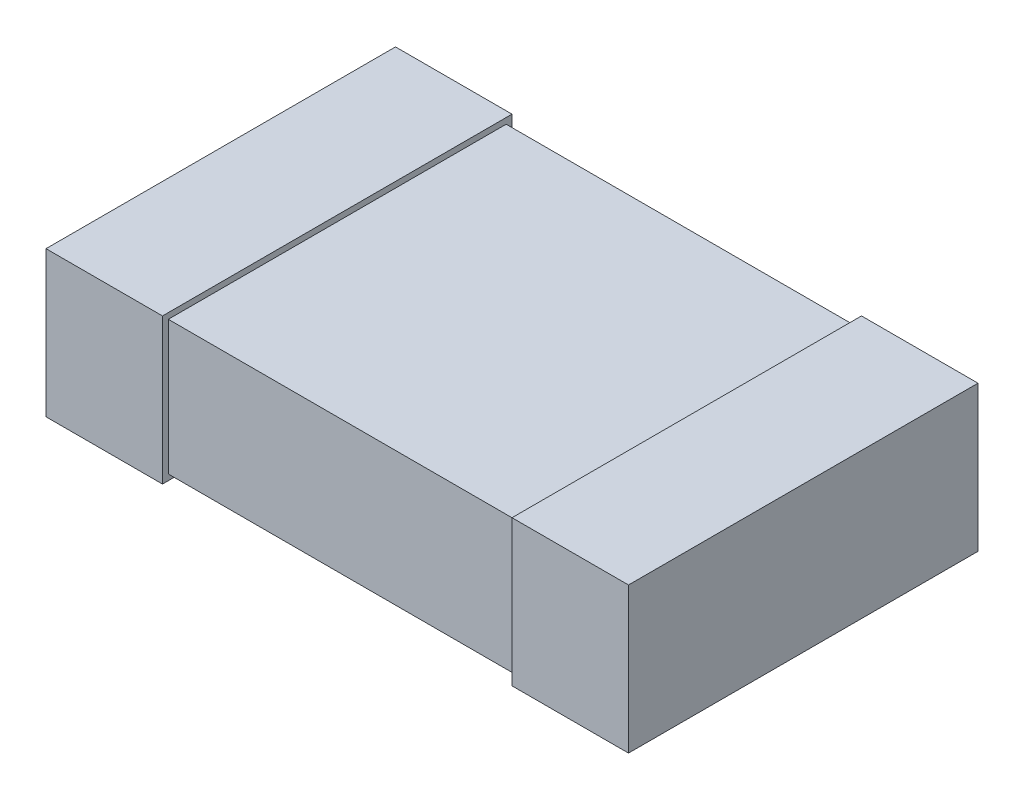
ISO-10303-21;
HEADER;
FILE_DESCRIPTION(('STEP AP214'),'2;1');
FILE_NAME('part.step','',(''),(''),'','','');
FILE_SCHEMA(('AUTOMOTIVE_DESIGN { 1 0 10303 214 1 1 1 1 }'));
ENDSEC;
DATA;
#1=APPLICATION_CONTEXT('core data for automotive mechanical design processes');
#2=APPLICATION_PROTOCOL_DEFINITION('international standard','automotive_design',2000,#1);
#3=PRODUCT_CONTEXT('',#1,'mechanical');
#4=PRODUCT('Part','Part','',(#3));
#5=PRODUCT_RELATED_PRODUCT_CATEGORY('part','',(#4));
#6=PRODUCT_DEFINITION_FORMATION('','',#4);
#7=PRODUCT_DEFINITION_CONTEXT('part definition',#1,'design');
#8=PRODUCT_DEFINITION('design','',#6,#7);
#9=PRODUCT_DEFINITION_SHAPE('','',#8);
#10=(LENGTH_UNIT() NAMED_UNIT(*) SI_UNIT(.MILLI.,.METRE.));
#11=(NAMED_UNIT(*) PLANE_ANGLE_UNIT() SI_UNIT($,.RADIAN.));
#12=(NAMED_UNIT(*) SI_UNIT($,.STERADIAN.) SOLID_ANGLE_UNIT());
#13=UNCERTAINTY_MEASURE_WITH_UNIT(LENGTH_MEASURE(1.E-05),#10,'distance_accuracy_value','');
#14=(GEOMETRIC_REPRESENTATION_CONTEXT(3) GLOBAL_UNCERTAINTY_ASSIGNED_CONTEXT((#13)) GLOBAL_UNIT_ASSIGNED_CONTEXT((#10,
#11,#12)) REPRESENTATION_CONTEXT('',''));
#15=CARTESIAN_POINT('',(0.,0.,0.));
#16=DIRECTION('',(0.,0.,1.));
#17=DIRECTION('',(1.,0.,0.));
#18=AXIS2_PLACEMENT_3D('',#15,#16,#17);
#19=CARTESIAN_POINT('',(-0.6,0.5,0.6));
#20=DIRECTION('',(-1.,0.,0.));
#21=DIRECTION('',(0.,0.,1.));
#22=AXIS2_PLACEMENT_3D('',#19,#20,#21);
#23=PLANE('',#22);
#24=DIRECTION('',(0.,0.,-1.));
#25=VECTOR('',#24,1.);
#26=CARTESIAN_POINT('',(-0.6,0.,0.6));
#27=LINE('',#26,#25);
#28=CARTESIAN_POINT('',(-0.6,0.,0.6));
#29=VERTEX_POINT('',#28);
#30=CARTESIAN_POINT('',(-0.6,0.,-0.6));
#31=VERTEX_POINT('',#30);
#32=EDGE_CURVE('E223',#29,#31,#27,.T.);
#33=ORIENTED_EDGE('',*,*,#32,.T.);
#34=DIRECTION('',(0.,-1.,0.));
#35=VECTOR('',#34,1.);
#36=CARTESIAN_POINT('',(-0.6,0.5,-0.6));
#37=LINE('',#36,#35);
#38=CARTESIAN_POINT('',(-0.6,0.5,-0.6));
#39=VERTEX_POINT('',#38);
#40=EDGE_CURVE('E231',#39,#31,#37,.T.);
#41=ORIENTED_EDGE('',*,*,#40,.F.);
#42=DIRECTION('',(0.,0.,-1.));
#43=VECTOR('',#42,1.);
#44=CARTESIAN_POINT('',(-0.6,0.5,0.6));
#45=LINE('',#44,#43);
#46=CARTESIAN_POINT('',(-0.6,0.5,0.6));
#47=VERTEX_POINT('',#46);
#48=EDGE_CURVE('E211',#47,#39,#45,.T.);
#49=ORIENTED_EDGE('',*,*,#48,.F.);
#50=DIRECTION('',(0.,-1.,0.));
#51=VECTOR('',#50,1.);
#52=CARTESIAN_POINT('',(-0.6,0.5,0.6));
#53=LINE('',#52,#51);
#54=EDGE_CURVE('E45',#47,#29,#53,.T.);
#55=ORIENTED_EDGE('',*,*,#54,.T.);
#56=EDGE_LOOP('',(#33,#41,#49,#55));
#57=FACE_BOUND('',#56,.T.);
#58=DIRECTION('',(0.,-1.,0.));
#59=VECTOR('',#58,1.);
#60=CARTESIAN_POINT('',(-0.6,0.48,0.58));
#61=LINE('',#60,#59);
#62=CARTESIAN_POINT('',(-0.6,0.48,0.58));
#63=VERTEX_POINT('',#62);
#64=CARTESIAN_POINT('',(-0.6,0.0200000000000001,0.58));
#65=VERTEX_POINT('',#64);
#66=EDGE_CURVE('E159',#63,#65,#61,.T.);
#67=ORIENTED_EDGE('',*,*,#66,.F.);
#68=DIRECTION('',(0.,0.,1.));
#69=VECTOR('',#68,1.);
#70=CARTESIAN_POINT('',(-0.6,0.48,-0.58));
#71=LINE('',#70,#69);
#72=CARTESIAN_POINT('',(-0.6,0.48,-0.58));
#73=VERTEX_POINT('',#72);
#74=EDGE_CURVE('E166',#73,#63,#71,.T.);
#75=ORIENTED_EDGE('',*,*,#74,.F.);
#76=DIRECTION('',(0.,1.,0.));
#77=VECTOR('',#76,1.);
#78=CARTESIAN_POINT('',(-0.6,0.0200000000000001,-0.58));
#79=LINE('',#78,#77);
#80=CARTESIAN_POINT('',(-0.6,0.0200000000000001,-0.58));
#81=VERTEX_POINT('',#80);
#82=EDGE_CURVE('E57',#81,#73,#79,.T.);
#83=ORIENTED_EDGE('',*,*,#82,.F.);
#84=DIRECTION('',(0.,0.,-1.));
#85=VECTOR('',#84,1.);
#86=CARTESIAN_POINT('',(-0.6,0.02,0.58));
#87=LINE('',#86,#85);
#88=EDGE_CURVE('E52',#65,#81,#87,.T.);
#89=ORIENTED_EDGE('',*,*,#88,.F.);
#90=EDGE_LOOP('',(#67,#75,#83,#89));
#91=FACE_BOUND('',#90,.T.);
#92=ADVANCED_FACE('F36',(#57,#91),#23,.F.);
#93=CARTESIAN_POINT('',(-1.,0.5,0.6));
#94=DIRECTION('',(1.,0.,0.));
#95=DIRECTION('',(0.,0.,-1.));
#96=AXIS2_PLACEMENT_3D('',#93,#94,#95);
#97=PLANE('',#96);
#98=DIRECTION('',(0.,0.,1.));
#99=VECTOR('',#98,1.);
#100=CARTESIAN_POINT('',(-1.,0.,0.6));
#101=LINE('',#100,#99);
#102=CARTESIAN_POINT('',(-1.,0.,-0.6));
#103=VERTEX_POINT('',#102);
#104=CARTESIAN_POINT('',(-1.,0.,0.6));
#105=VERTEX_POINT('',#104);
#106=EDGE_CURVE('E185',#103,#105,#101,.T.);
#107=ORIENTED_EDGE('',*,*,#106,.T.);
#108=DIRECTION('',(0.,-1.,0.));
#109=VECTOR('',#108,1.);
#110=CARTESIAN_POINT('',(-1.,0.5,0.6));
#111=LINE('',#110,#109);
#112=CARTESIAN_POINT('',(-1.,0.5,0.6));
#113=VERTEX_POINT('',#112);
#114=EDGE_CURVE('E11',#113,#105,#111,.T.);
#115=ORIENTED_EDGE('',*,*,#114,.F.);
#116=DIRECTION('',(0.,0.,1.));
#117=VECTOR('',#116,1.);
#118=CARTESIAN_POINT('',(-1.,0.5,0.6));
#119=LINE('',#118,#117);
#120=CARTESIAN_POINT('',(-1.,0.5,-0.6));
#121=VERTEX_POINT('',#120);
#122=EDGE_CURVE('E204',#121,#113,#119,.T.);
#123=ORIENTED_EDGE('',*,*,#122,.F.);
#124=DIRECTION('',(0.,-1.,0.));
#125=VECTOR('',#124,1.);
#126=CARTESIAN_POINT('',(-1.,0.5,-0.6));
#127=LINE('',#126,#125);
#128=EDGE_CURVE('E217',#121,#103,#127,.T.);
#129=ORIENTED_EDGE('',*,*,#128,.T.);
#130=EDGE_LOOP('',(#107,#115,#123,#129));
#131=FACE_BOUND('',#130,.T.);
#132=ADVANCED_FACE('F38',(#131),#97,.F.);
#133=CARTESIAN_POINT('',(-1.,0.5,0.6));
#134=DIRECTION('',(0.,0.,-1.));
#135=DIRECTION('',(-1.,0.,0.));
#136=AXIS2_PLACEMENT_3D('',#133,#134,#135);
#137=PLANE('',#136);
#138=DIRECTION('',(1.,0.,0.));
#139=VECTOR('',#138,1.);
#140=CARTESIAN_POINT('',(-1.,0.,0.6));
#141=LINE('',#140,#139);
#142=EDGE_CURVE('E220',#105,#29,#141,.T.);
#143=ORIENTED_EDGE('',*,*,#142,.T.);
#144=ORIENTED_EDGE('',*,*,#54,.F.);
#145=DIRECTION('',(1.,0.,0.));
#146=VECTOR('',#145,1.);
#147=CARTESIAN_POINT('',(-1.,0.5,0.6));
#148=LINE('',#147,#146);
#149=EDGE_CURVE('E208',#113,#47,#148,.T.);
#150=ORIENTED_EDGE('',*,*,#149,.F.);
#151=ORIENTED_EDGE('',*,*,#114,.T.);
#152=EDGE_LOOP('',(#143,#144,#150,#151));
#153=FACE_BOUND('',#152,.T.);
#154=ADVANCED_FACE('F257',(#153),#137,.F.);
#155=CARTESIAN_POINT('',(-1.,0.5,-0.6));
#156=DIRECTION('',(0.,0.,1.));
#157=DIRECTION('',(1.,0.,0.));
#158=AXIS2_PLACEMENT_3D('',#155,#156,#157);
#159=PLANE('',#158);
#160=DIRECTION('',(-1.,0.,0.));
#161=VECTOR('',#160,1.);
#162=CARTESIAN_POINT('',(-1.,0.,-0.6));
#163=LINE('',#162,#161);
#164=EDGE_CURVE('E209',#31,#103,#163,.T.);
#165=ORIENTED_EDGE('',*,*,#164,.T.);
#166=ORIENTED_EDGE('',*,*,#128,.F.);
#167=DIRECTION('',(-1.,0.,0.));
#168=VECTOR('',#167,1.);
#169=CARTESIAN_POINT('',(-1.,0.5,-0.6));
#170=LINE('',#169,#168);
#171=EDGE_CURVE('E214',#39,#121,#170,.T.);
#172=ORIENTED_EDGE('',*,*,#171,.F.);
#173=ORIENTED_EDGE('',*,*,#40,.T.);
#174=EDGE_LOOP('',(#165,#166,#172,#173));
#175=FACE_BOUND('',#174,.T.);
#176=ADVANCED_FACE('F250',(#175),#159,.F.);
#177=CARTESIAN_POINT('',(-1.,0.5,-0.6));
#178=DIRECTION('',(0.,-1.,0.));
#179=DIRECTION('',(0.,0.,-1.));
#180=AXIS2_PLACEMENT_3D('',#177,#178,#179);
#181=PLANE('',#180);
#182=ORIENTED_EDGE('',*,*,#122,.T.);
#183=ORIENTED_EDGE('',*,*,#149,.T.);
#184=ORIENTED_EDGE('',*,*,#48,.T.);
#185=ORIENTED_EDGE('',*,*,#171,.T.);
#186=EDGE_LOOP('',(#182,#183,#184,#185));
#187=FACE_BOUND('',#186,.T.);
#188=ADVANCED_FACE('F256',(#187),#181,.F.);
#189=CARTESIAN_POINT('',(-1.,0.,-0.6));
#190=DIRECTION('',(0.,-1.,0.));
#191=DIRECTION('',(0.,0.,-1.));
#192=AXIS2_PLACEMENT_3D('',#189,#190,#191);
#193=PLANE('',#192);
#194=ORIENTED_EDGE('',*,*,#106,.F.);
#195=ORIENTED_EDGE('',*,*,#164,.F.);
#196=ORIENTED_EDGE('',*,*,#32,.F.);
#197=ORIENTED_EDGE('',*,*,#142,.F.);
#198=EDGE_LOOP('',(#194,#195,#196,#197));
#199=FACE_BOUND('',#198,.T.);
#200=ADVANCED_FACE('F247',(#199),#193,.T.);
#201=CARTESIAN_POINT('',(1.84787819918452,0.48,0.58));
#202=DIRECTION('',(0.,0.,-1.));
#203=DIRECTION('',(0.,1.,0.));
#204=AXIS2_PLACEMENT_3D('',#201,#202,#203);
#205=PLANE('',#204);
#206=DIRECTION('',(0.,-1.,0.));
#207=VECTOR('',#206,1.);
#208=CARTESIAN_POINT('',(0.6,0.48,0.58));
#209=LINE('',#208,#207);
#210=CARTESIAN_POINT('',(0.6,0.48,0.58));
#211=VERTEX_POINT('',#210);
#212=CARTESIAN_POINT('',(0.600000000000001,0.02,0.58));
#213=VERTEX_POINT('',#212);
#214=EDGE_CURVE('E190',#211,#213,#209,.T.);
#215=ORIENTED_EDGE('',*,*,#214,.F.);
#216=DIRECTION('',(-1.,0.,0.));
#217=VECTOR('',#216,1.);
#218=CARTESIAN_POINT('',(1.84787819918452,0.48,0.58));
#219=LINE('',#218,#217);
#220=EDGE_CURVE('E153',#211,#63,#219,.T.);
#221=ORIENTED_EDGE('',*,*,#220,.T.);
#222=ORIENTED_EDGE('',*,*,#66,.T.);
#223=DIRECTION('',(-1.,0.,0.));
#224=VECTOR('',#223,1.);
#225=CARTESIAN_POINT('',(1.84787819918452,0.02,0.58));
#226=LINE('',#225,#224);
#227=EDGE_CURVE('E177',#213,#65,#226,.T.);
#228=ORIENTED_EDGE('',*,*,#227,.F.);
#229=EDGE_LOOP('',(#215,#221,#222,#228));
#230=FACE_BOUND('',#229,.T.);
#231=ADVANCED_FACE('F269',(#230),#205,.F.);
#232=CARTESIAN_POINT('',(1.84787819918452,0.02,0.58));
#233=DIRECTION('',(0.,1.,0.));
#234=DIRECTION('',(0.,0.,1.));
#235=AXIS2_PLACEMENT_3D('',#232,#233,#234);
#236=PLANE('',#235);
#237=DIRECTION('',(0.,0.,-1.));
#238=VECTOR('',#237,1.);
#239=CARTESIAN_POINT('',(0.6,0.02,0.58));
#240=LINE('',#239,#238);
#241=CARTESIAN_POINT('',(0.600000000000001,0.0200000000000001,-0.58));
#242=VERTEX_POINT('',#241);
#243=EDGE_CURVE('E186',#213,#242,#240,.T.);
#244=ORIENTED_EDGE('',*,*,#243,.F.);
#245=ORIENTED_EDGE('',*,*,#227,.T.);
#246=ORIENTED_EDGE('',*,*,#88,.T.);
#247=DIRECTION('',(-1.,0.,0.));
#248=VECTOR('',#247,1.);
#249=CARTESIAN_POINT('',(1.84787819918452,0.0200000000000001,-0.58));
#250=LINE('',#249,#248);
#251=EDGE_CURVE('E174',#242,#81,#250,.T.);
#252=ORIENTED_EDGE('',*,*,#251,.F.);
#253=EDGE_LOOP('',(#244,#245,#246,#252));
#254=FACE_BOUND('',#253,.T.);
#255=ADVANCED_FACE('F274',(#254),#236,.F.);
#256=CARTESIAN_POINT('',(1.84787819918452,0.0200000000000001,-0.58));
#257=DIRECTION('',(0.,0.,1.));
#258=DIRECTION('',(1.,0.,0.));
#259=AXIS2_PLACEMENT_3D('',#256,#257,#258);
#260=PLANE('',#259);
#261=DIRECTION('',(0.,1.,0.));
#262=VECTOR('',#261,1.);
#263=CARTESIAN_POINT('',(0.6,0.0200000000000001,-0.58));
#264=LINE('',#263,#262);
#265=CARTESIAN_POINT('',(0.600000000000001,0.48,-0.58));
#266=VERTEX_POINT('',#265);
#267=EDGE_CURVE('E181',#242,#266,#264,.T.);
#268=ORIENTED_EDGE('',*,*,#267,.F.);
#269=ORIENTED_EDGE('',*,*,#251,.T.);
#270=ORIENTED_EDGE('',*,*,#82,.T.);
#271=DIRECTION('',(-1.,0.,0.));
#272=VECTOR('',#271,1.);
#273=CARTESIAN_POINT('',(1.84787819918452,0.48,-0.58));
#274=LINE('',#273,#272);
#275=EDGE_CURVE('E171',#266,#73,#274,.T.);
#276=ORIENTED_EDGE('',*,*,#275,.F.);
#277=EDGE_LOOP('',(#268,#269,#270,#276));
#278=FACE_BOUND('',#277,.T.);
#279=ADVANCED_FACE('F278',(#278),#260,.F.);
#280=CARTESIAN_POINT('',(1.84787819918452,0.48,-0.58));
#281=DIRECTION('',(0.,-1.,0.));
#282=DIRECTION('',(0.,0.,-1.));
#283=AXIS2_PLACEMENT_3D('',#280,#281,#282);
#284=PLANE('',#283);
#285=DIRECTION('',(0.,0.,1.));
#286=VECTOR('',#285,1.);
#287=CARTESIAN_POINT('',(0.6,0.48,-0.58));
#288=LINE('',#287,#286);
#289=EDGE_CURVE('E170',#266,#211,#288,.T.);
#290=ORIENTED_EDGE('',*,*,#289,.F.);
#291=ORIENTED_EDGE('',*,*,#275,.T.);
#292=ORIENTED_EDGE('',*,*,#74,.T.);
#293=ORIENTED_EDGE('',*,*,#220,.F.);
#294=EDGE_LOOP('',(#290,#291,#292,#293));
#295=FACE_BOUND('',#294,.T.);
#296=ADVANCED_FACE('F282',(#295),#284,.F.);
#297=CARTESIAN_POINT('',(0.6,0.5,0.6));
#298=DIRECTION('',(1.,0.,0.));
#299=DIRECTION('',(0.,0.,-1.));
#300=AXIS2_PLACEMENT_3D('',#297,#298,#299);
#301=PLANE('',#300);
#302=DIRECTION('',(0.,0.,1.));
#303=VECTOR('',#302,1.);
#304=CARTESIAN_POINT('',(0.6,0.,0.6));
#305=LINE('',#304,#303);
#306=CARTESIAN_POINT('',(0.6,0.,-0.6));
#307=VERTEX_POINT('',#306);
#308=CARTESIAN_POINT('',(0.6,0.,0.6));
#309=VERTEX_POINT('',#308);
#310=EDGE_CURVE('E147',#307,#309,#305,.T.);
#311=ORIENTED_EDGE('',*,*,#310,.T.);
#312=DIRECTION('',(0.,-1.,0.));
#313=VECTOR('',#312,1.);
#314=CARTESIAN_POINT('',(0.6,0.5,0.6));
#315=LINE('',#314,#313);
#316=CARTESIAN_POINT('',(0.6,0.5,0.6));
#317=VERTEX_POINT('',#316);
#318=EDGE_CURVE('E429',#317,#309,#315,.T.);
#319=ORIENTED_EDGE('',*,*,#318,.F.);
#320=DIRECTION('',(0.,0.,1.));
#321=VECTOR('',#320,1.);
#322=CARTESIAN_POINT('',(0.6,0.5,0.6));
#323=LINE('',#322,#321);
#324=CARTESIAN_POINT('',(0.6,0.5,-0.6));
#325=VERTEX_POINT('',#324);
#326=EDGE_CURVE('E142',#325,#317,#323,.T.);
#327=ORIENTED_EDGE('',*,*,#326,.F.);
#328=DIRECTION('',(0.,-1.,0.));
#329=VECTOR('',#328,1.);
#330=CARTESIAN_POINT('',(0.6,0.5,-0.6));
#331=LINE('',#330,#329);
#332=EDGE_CURVE('E162',#325,#307,#331,.T.);
#333=ORIENTED_EDGE('',*,*,#332,.T.);
#334=EDGE_LOOP('',(#311,#319,#327,#333));
#335=FACE_BOUND('',#334,.T.);
#336=ORIENTED_EDGE('',*,*,#289,.T.);
#337=ORIENTED_EDGE('',*,*,#214,.T.);
#338=ORIENTED_EDGE('',*,*,#243,.T.);
#339=ORIENTED_EDGE('',*,*,#267,.T.);
#340=EDGE_LOOP('',(#336,#337,#338,#339));
#341=FACE_BOUND('',#340,.T.);
#342=ADVANCED_FACE('F286',(#335,#341),#301,.F.);
#343=CARTESIAN_POINT('',(1.,0.5,0.6));
#344=DIRECTION('',(0.,0.,-1.));
#345=DIRECTION('',(-1.,0.,0.));
#346=AXIS2_PLACEMENT_3D('',#343,#344,#345);
#347=PLANE('',#346);
#348=DIRECTION('',(1.,0.,0.));
#349=VECTOR('',#348,1.);
#350=CARTESIAN_POINT('',(1.,0.,0.6));
#351=LINE('',#350,#349);
#352=CARTESIAN_POINT('',(1.,0.,0.6));
#353=VERTEX_POINT('',#352);
#354=EDGE_CURVE('E151',#309,#353,#351,.T.);
#355=ORIENTED_EDGE('',*,*,#354,.T.);
#356=DIRECTION('',(0.,-1.,0.));
#357=VECTOR('',#356,1.);
#358=CARTESIAN_POINT('',(1.,0.5,0.6));
#359=LINE('',#358,#357);
#360=CARTESIAN_POINT('',(1.,0.5,0.6));
#361=VERTEX_POINT('',#360);
#362=EDGE_CURVE('E129',#361,#353,#359,.T.);
#363=ORIENTED_EDGE('',*,*,#362,.F.);
#364=DIRECTION('',(1.,0.,0.));
#365=VECTOR('',#364,1.);
#366=CARTESIAN_POINT('',(1.,0.5,0.6));
#367=LINE('',#366,#365);
#368=EDGE_CURVE('E137',#317,#361,#367,.T.);
#369=ORIENTED_EDGE('',*,*,#368,.F.);
#370=ORIENTED_EDGE('',*,*,#318,.T.);
#371=EDGE_LOOP('',(#355,#363,#369,#370));
#372=FACE_BOUND('',#371,.T.);
#373=ADVANCED_FACE('F149',(#372),#347,.F.);
#374=CARTESIAN_POINT('',(1.,0.5,0.6));
#375=DIRECTION('',(-1.,0.,0.));
#376=DIRECTION('',(0.,0.,1.));
#377=AXIS2_PLACEMENT_3D('',#374,#375,#376);
#378=PLANE('',#377);
#379=DIRECTION('',(0.,0.,-1.));
#380=VECTOR('',#379,1.);
#381=CARTESIAN_POINT('',(1.,0.,0.6));
#382=LINE('',#381,#380);
#383=CARTESIAN_POINT('',(1.,0.,-0.6));
#384=VERTEX_POINT('',#383);
#385=EDGE_CURVE('E416',#353,#384,#382,.T.);
#386=ORIENTED_EDGE('',*,*,#385,.T.);
#387=DIRECTION('',(0.,-1.,0.));
#388=VECTOR('',#387,1.);
#389=CARTESIAN_POINT('',(1.,0.5,-0.6));
#390=LINE('',#389,#388);
#391=CARTESIAN_POINT('',(1.,0.5,-0.6));
#392=VERTEX_POINT('',#391);
#393=EDGE_CURVE('E132',#392,#384,#390,.T.);
#394=ORIENTED_EDGE('',*,*,#393,.F.);
#395=DIRECTION('',(0.,0.,-1.));
#396=VECTOR('',#395,1.);
#397=CARTESIAN_POINT('',(1.,0.5,0.6));
#398=LINE('',#397,#396);
#399=EDGE_CURVE('E125',#361,#392,#398,.T.);
#400=ORIENTED_EDGE('',*,*,#399,.F.);
#401=ORIENTED_EDGE('',*,*,#362,.T.);
#402=EDGE_LOOP('',(#386,#394,#400,#401));
#403=FACE_BOUND('',#402,.T.);
#404=ADVANCED_FACE('F127',(#403),#378,.F.);
#405=CARTESIAN_POINT('',(1.,0.5,-0.6));
#406=DIRECTION('',(0.,0.,1.));
#407=DIRECTION('',(1.,0.,0.));
#408=AXIS2_PLACEMENT_3D('',#405,#406,#407);
#409=PLANE('',#408);
#410=DIRECTION('',(-1.,0.,0.));
#411=VECTOR('',#410,1.);
#412=CARTESIAN_POINT('',(1.,0.,-0.6));
#413=LINE('',#412,#411);
#414=EDGE_CURVE('E420',#384,#307,#413,.T.);
#415=ORIENTED_EDGE('',*,*,#414,.T.);
#416=ORIENTED_EDGE('',*,*,#332,.F.);
#417=DIRECTION('',(-1.,0.,0.));
#418=VECTOR('',#417,1.);
#419=CARTESIAN_POINT('',(1.,0.5,-0.6));
#420=LINE('',#419,#418);
#421=EDGE_CURVE('E136',#392,#325,#420,.T.);
#422=ORIENTED_EDGE('',*,*,#421,.F.);
#423=ORIENTED_EDGE('',*,*,#393,.T.);
#424=EDGE_LOOP('',(#415,#416,#422,#423));
#425=FACE_BOUND('',#424,.T.);
#426=ADVANCED_FACE('F292',(#425),#409,.F.);
#427=CARTESIAN_POINT('',(0.6,0.5,0.6));
#428=DIRECTION('',(0.,-1.,0.));
#429=DIRECTION('',(0.,0.,-1.));
#430=AXIS2_PLACEMENT_3D('',#427,#428,#429);
#431=PLANE('',#430);
#432=ORIENTED_EDGE('',*,*,#368,.T.);
#433=ORIENTED_EDGE('',*,*,#399,.T.);
#434=ORIENTED_EDGE('',*,*,#421,.T.);
#435=ORIENTED_EDGE('',*,*,#326,.T.);
#436=EDGE_LOOP('',(#432,#433,#434,#435));
#437=FACE_BOUND('',#436,.T.);
#438=ADVANCED_FACE('F140',(#437),#431,.F.);
#439=CARTESIAN_POINT('',(0.6,0.,0.6));
#440=DIRECTION('',(0.,-1.,0.));
#441=DIRECTION('',(0.,0.,-1.));
#442=AXIS2_PLACEMENT_3D('',#439,#440,#441);
#443=PLANE('',#442);
#444=ORIENTED_EDGE('',*,*,#354,.F.);
#445=ORIENTED_EDGE('',*,*,#310,.F.);
#446=ORIENTED_EDGE('',*,*,#414,.F.);
#447=ORIENTED_EDGE('',*,*,#385,.F.);
#448=EDGE_LOOP('',(#444,#445,#446,#447));
#449=FACE_BOUND('',#448,.T.);
#450=ADVANCED_FACE('F299',(#449),#443,.T.);
#451=CLOSED_SHELL('',(#92,#132,#154,#176,#188,#200,#231,#255,#279,#296,#342,#373,#404,#426,#438,#450));
#452=MANIFOLD_SOLID_BREP('B2',#451);
#453=ADVANCED_BREP_SHAPE_REPRESENTATION('',(#18,#452),#14);
#454=SHAPE_DEFINITION_REPRESENTATION(#9,#453);
ENDSEC;
END-ISO-10303-21;
